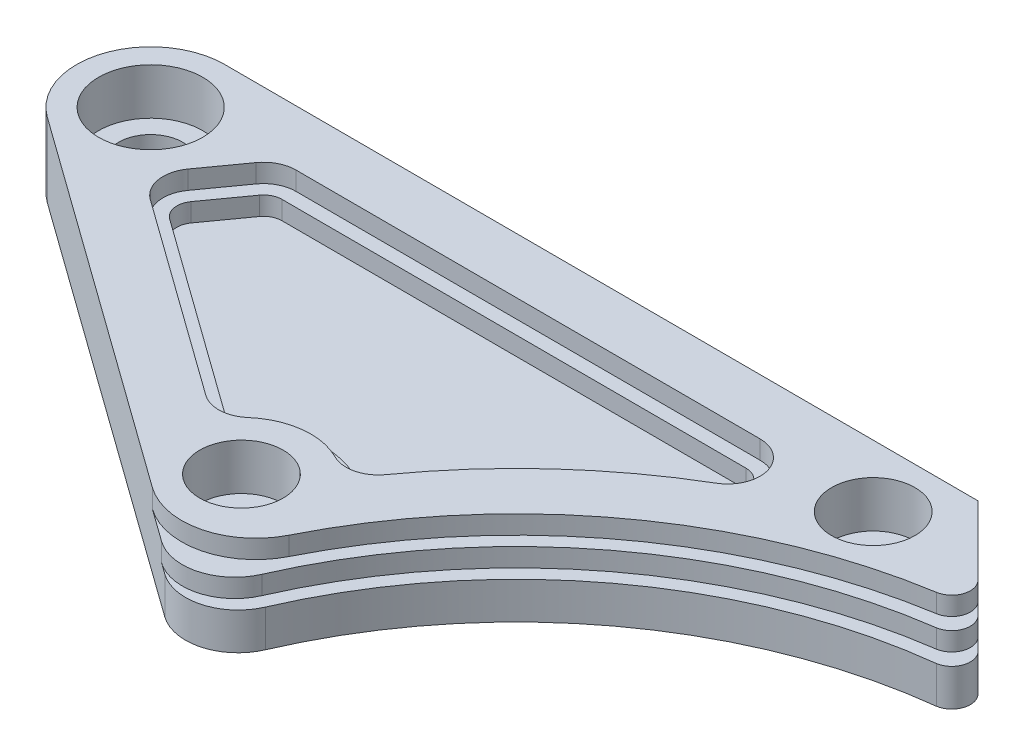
from build123d import *

# Parameters (mm, degrees)
BOSS_EXTRUDE1_DEPTH                      = 3.175
BOSS_EXTRUDE2_DEPTH                      = 3.1750000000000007
BOSS_EXTRUDE3_DEPTH                      = 6.349999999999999
CUT_EXTRUDE1_DEPTH                       = 3.174999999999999
CUT_EXTRUDE2_DEPTH                       = 3.1750000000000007
DRAFT1_ANGLE                             = 35.60594944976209
HOLE1_D                                  = 7.9375
HOLE1_CBORE_D                            = 14.2875
HOLE1_CBORE_DEPTH                        = 7.9375
CBORE_FOR_M10_HEX_HEAD_BOLT1_D           = 10.9982
CBORE_FOR_M10_HEX_HEAD_BOLT1_CBORE_D     = 17.8575
CBORE_FOR_M10_HEX_HEAD_BOLT1_CBORE_DEPTH = 7.9375
FILLET1_R                                = 12.699999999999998
FILLET3_R                                = 9.000000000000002
FILLET4_R                                = 3.17373
FILLET5_R                                = 5.5549800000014
FILLET6_R                                = 9
BODY_MOVE_COPY1_ANGLE                    = 89.99999999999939


with BuildPart() as part:
    # Sketch1 → Boss-Extrude1 (new body)
    with BuildSketch(Plane.XY.offset(12.7)):
        with BuildLine():
            Line((-7.411102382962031, -10.31336809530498), (69.81747298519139, -65.8091938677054))
            ThreePointArc((69.81747298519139, -65.8091938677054), (95.77222934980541, -25.197202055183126), (139.3738712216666, -4.65748241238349))
            ThreePointArc((139.3738712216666, -4.65748241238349), (141.8909232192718, -2.5004589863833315), (141.11529567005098, 0.722381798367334))
            Line((141.11529567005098, 0.722381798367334), (129.3516078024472, 12.486069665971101))
            Line((129.3516078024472, 12.486069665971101), (0.021005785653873, 12.699982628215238))
            ThreePointArc((0.021005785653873, 12.699982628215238), (-12.085402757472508, 3.9029527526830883), (-7.411102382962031, -10.31336809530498))
        make_face()
    extrude(amount=-BOSS_EXTRUDE1_DEPTH)

    # Sketch2 → Boss-Extrude2 (add)
    with BuildSketch(Plane(origin=(0, 0, 9.524999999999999), x_dir=(-1, 0, 0), z_dir=(0, 0, -1))):
        with BuildLine():
            Line((-143.2087745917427, -1.3710971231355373), (-129.3516078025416, 12.48606966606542))
            Line((-129.3516078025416, 12.48606966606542), (-0.02100578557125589, 12.699982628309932))
            ThreePointArc((-0.02100578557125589, 12.699982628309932), (12.085402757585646, 3.90295275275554), (7.411102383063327, -10.313368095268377))
            Line((7.411102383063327, -10.313368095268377), (-71.86883360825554, -67.28328491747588))
            ThreePointArc((-71.86883360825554, -67.28328491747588), (-97.68462692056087, -26.68816502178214), (-141.4673501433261, -6.750961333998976))
            ThreePointArc((-141.4673501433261, -6.750961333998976), (-143.98440214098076, -4.593937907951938), (-143.2087745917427, -1.3710971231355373))
        make_face()
    extrude(amount=BOSS_EXTRUDE2_DEPTH)

    # Sketch3 → Boss-Extrude3 (add)
    with BuildSketch(Plane(origin=(0, 0, 6.349999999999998), x_dir=(-1, 0, 0), z_dir=(0, 0, -1))):
        with BuildLine():
            Line((-145.3361910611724, -3.498513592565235), (-129.3516078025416, 12.48606966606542))
            Line((-129.3516078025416, 12.48606966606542), (-0.02100578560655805, 12.699982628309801))
            ThreePointArc((-0.02100578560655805, 12.699982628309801), (12.085402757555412, 3.9029527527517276), (7.41110238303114, -10.313368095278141))
            Line((7.41110238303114, -10.313368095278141), (-73.92768758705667, -68.76276063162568))
            ThreePointArc((-73.92768758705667, -68.76276063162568), (-99.6084882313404, -28.172641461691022), (-143.5947666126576, -8.87837780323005))
            ThreePointArc((-143.5947666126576, -8.87837780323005), (-146.11181861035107, -6.721354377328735), (-145.3361910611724, -3.498513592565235))
        make_face()
    extrude(amount=BOSS_EXTRUDE3_DEPTH)

    # Sketch4 → Cut-Extrude1 (cut)
    with BuildSketch(Plane.XY.offset(12.7)):
        with BuildLine():
            Line((9.131576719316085, -10.471608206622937), (51.73755055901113, -41.08791427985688))
            ThreePointArc((51.73755055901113, -41.08791427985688), (61.10239035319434, -34.833453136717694), (71.49066179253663, -39.181133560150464))
            ThreePointArc((71.49066179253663, -39.181133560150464), (85.97230614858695, -21.28803133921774), (104.28172417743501, -7.3364600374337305))
            ThreePointArc((104.28172417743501, -7.3364600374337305), (106.82747849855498, -1.093314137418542), (101.4754866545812, 3.00716377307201))
            Line((101.4754866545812, 3.00716377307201), (18.915439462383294, 3.143718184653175))
            Line((18.915439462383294, 3.143718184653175), (9.131576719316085, -10.471608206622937))
        make_face()
    extrude(amount=-CUT_EXTRUDE1_DEPTH, mode=Mode.SUBTRACT)

    # Sketch5 → Cut-Extrude2 (cut)
    with BuildSketch(Plane.XY.offset(9.525)):
        with BuildLine():
            Line((101.47154806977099, 0.625917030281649), (20.135139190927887, 0.7604475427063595))
            Line((20.135139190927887, 0.7604475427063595), (20.108364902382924, -15.427140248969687))
            Line((20.108364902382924, -15.427140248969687), (51.12496458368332, -37.71541636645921))
            ThreePointArc((51.12496458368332, -37.71541636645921), (60.634305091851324, -32.48835427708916), (71.07354417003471, -35.45011430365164))
            ThreePointArc((71.07354417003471, -35.45011430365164), (85.37480133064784, -18.56415708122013), (103.07483740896, -5.283711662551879))
            ThreePointArc((103.07483740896, -5.283711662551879), (104.52930472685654, -1.716811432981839), (101.47154806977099, 0.625917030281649))
        make_face()
    extrude(amount=-CUT_EXTRUDE2_DEPTH, mode=Mode.SUBTRACT)

    # Draft1
    draft1_faces = [part.faces().sort_by_distance(p)[0] for p in [
        (20.121752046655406, -7.333346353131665, 7.9375),
    ]]
    draft(draft1_faces, Plane(origin=(101.47154806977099, 0.625917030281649, 6.35), x_dir=(-0.9999986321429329, 0.0016539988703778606, 0), z_dir=(-0.0016539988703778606, -0.9999986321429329, 0)), DRAFT1_ANGLE)

    # Hole1 (through all)
    with Locations(Plane.XY.offset(12.7)):
        with Locations((62.246390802, -46.684615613), (121.968512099, 1.908653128)):
            CounterBoreHole(HOLE1_D / 2, HOLE1_CBORE_D / 2, HOLE1_CBORE_DEPTH)

    # CBORE for M10 Hex Head Bolt1 (through all)
    with Locations(Plane.XY.offset(12.7)):
        with Locations((0, 0)):
            CounterBoreHole(CBORE_FOR_M10_HEX_HEAD_BOLT1_D / 2, CBORE_FOR_M10_HEX_HEAD_BOLT1_CBORE_D / 2, CBORE_FOR_M10_HEX_HEAD_BOLT1_CBORE_DEPTH)

    # Fillet1
    fillet1_edges = [part.edges().sort_by_distance(p)[0] for p in [
        (69.81747298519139, -65.8091938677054, 11.112499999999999),
    ]]
    fillet(fillet1_edges, radius=FILLET1_R)

    # Fillet3
    fillet3_edges = [part.edges().sort_by_distance(p)[0] for p in [
        (71.86883360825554, -67.28328491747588, 7.937499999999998),
    ]]
    fillet(fillet3_edges, radius=FILLET3_R)

    # Fillet4
    fillet4_edges = [part.edges().sort_by_distance(p)[0] for p in [
        (71.0735441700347, -35.45011430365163, 7.9375),
        (51.12496458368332, -37.71541636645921, 7.9375),
        (12.454914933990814, -9.927433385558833, 7.9375),
        (20.135139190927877, 0.7604475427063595, 7.9375),
    ]]
    fillet(fillet4_edges, radius=FILLET4_R)

    # Fillet5
    fillet5_edges = [part.edges().sort_by_distance(p)[0] for p in [
        (9.131576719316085, -10.471608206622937, 11.1125),
        (18.915439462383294, 3.143718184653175, 11.1125),
        (71.49066179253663, -39.18113356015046, 11.1125),
        (51.737550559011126, -41.08791427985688, 11.1125),
    ]]
    fillet(fillet5_edges, radius=FILLET5_R)

    # Fillet6
    fillet6_edges = [part.edges().sort_by_distance(p)[0] for p in [
        (73.92768758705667, -68.76276063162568, 3.1749999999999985),
    ]]
    fillet(fillet6_edges, radius=FILLET6_R)


with BuildPart() as part_1:
    # Body-Move_Copy1: moved
    add(part.part.rotate(Axis((0, -25.37348761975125, 6.350012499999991), (-1, 0, 0)), BODY_MOVE_COPY1_ANGLE))


solid = part_1.part
